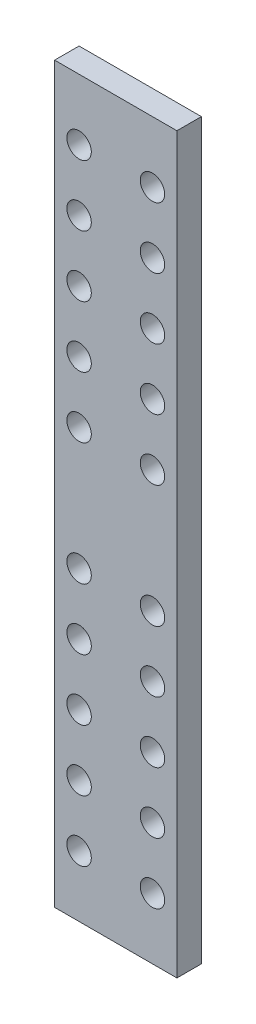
ISO-10303-21;
HEADER;
FILE_DESCRIPTION(('STEP AP214'),'2;1');
FILE_NAME('part.step','',(''),(''),'','','');
FILE_SCHEMA(('AUTOMOTIVE_DESIGN { 1 0 10303 214 1 1 1 1 }'));
ENDSEC;
DATA;
#1=APPLICATION_CONTEXT('core data for automotive mechanical design processes');
#2=APPLICATION_PROTOCOL_DEFINITION('international standard','automotive_design',2000,#1);
#3=PRODUCT_CONTEXT('',#1,'mechanical');
#4=PRODUCT('Part','Part','',(#3));
#5=PRODUCT_RELATED_PRODUCT_CATEGORY('part','',(#4));
#6=PRODUCT_DEFINITION_FORMATION('','',#4);
#7=PRODUCT_DEFINITION_CONTEXT('part definition',#1,'design');
#8=PRODUCT_DEFINITION('design','',#6,#7);
#9=PRODUCT_DEFINITION_SHAPE('','',#8);
#10=(LENGTH_UNIT() NAMED_UNIT(*) SI_UNIT(.MILLI.,.METRE.));
#11=(NAMED_UNIT(*) PLANE_ANGLE_UNIT() SI_UNIT($,.RADIAN.));
#12=(NAMED_UNIT(*) SI_UNIT($,.STERADIAN.) SOLID_ANGLE_UNIT());
#13=UNCERTAINTY_MEASURE_WITH_UNIT(LENGTH_MEASURE(1.E-05),#10,'distance_accuracy_value','');
#14=(GEOMETRIC_REPRESENTATION_CONTEXT(3) GLOBAL_UNCERTAINTY_ASSIGNED_CONTEXT((#13)) GLOBAL_UNIT_ASSIGNED_CONTEXT((#10,
#11,#12)) REPRESENTATION_CONTEXT('',''));
#15=CARTESIAN_POINT('',(0.,0.,0.));
#16=DIRECTION('',(0.,0.,1.));
#17=DIRECTION('',(1.,0.,0.));
#18=AXIS2_PLACEMENT_3D('',#15,#16,#17);
#19=CARTESIAN_POINT('',(0.,0.,10.));
#20=DIRECTION('',(0.,0.,-1.));
#21=DIRECTION('',(-1.,0.,0.));
#22=AXIS2_PLACEMENT_3D('',#19,#20,#21);
#23=PLANE('',#22);
#24=CARTESIAN_POINT('',(15.,-25.,10.));
#25=DIRECTION('',(0.,0.,1.));
#26=DIRECTION('',(1.,0.,0.));
#27=AXIS2_PLACEMENT_3D('',#24,#25,#26);
#28=CIRCLE('',#27,5.);
#29=CARTESIAN_POINT('',(20.,-25.,10.));
#30=VERTEX_POINT('',#29);
#31=EDGE_CURVE('E182',#30,#30,#28,.T.);
#32=ORIENTED_EDGE('',*,*,#31,.F.);
#33=EDGE_LOOP('',(#32));
#34=FACE_BOUND('',#33,.T.);
#35=CARTESIAN_POINT('',(15.,100.,10.));
#36=DIRECTION('',(0.,0.,1.));
#37=DIRECTION('',(1.,0.,0.));
#38=AXIS2_PLACEMENT_3D('',#35,#36,#37);
#39=CIRCLE('',#38,5.);
#40=CARTESIAN_POINT('',(20.,100.,10.));
#41=VERTEX_POINT('',#40);
#42=EDGE_CURVE('E166',#41,#41,#39,.T.);
#43=ORIENTED_EDGE('',*,*,#42,.F.);
#44=EDGE_LOOP('',(#43));
#45=FACE_BOUND('',#44,.T.);
#46=CARTESIAN_POINT('',(-15.,50.,10.));
#47=DIRECTION('',(0.,0.,1.));
#48=DIRECTION('',(1.,0.,0.));
#49=AXIS2_PLACEMENT_3D('',#46,#47,#48);
#50=CIRCLE('',#49,5.);
#51=CARTESIAN_POINT('',(-9.99999999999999,50.,10.));
#52=VERTEX_POINT('',#51);
#53=EDGE_CURVE('E130',#52,#52,#50,.T.);
#54=ORIENTED_EDGE('',*,*,#53,.F.);
#55=EDGE_LOOP('',(#54));
#56=FACE_BOUND('',#55,.T.);
#57=DIRECTION('',(0.,-1.,0.));
#58=VECTOR('',#57,1.);
#59=CARTESIAN_POINT('',(-25.,150.,10.));
#60=LINE('',#59,#58);
#61=CARTESIAN_POINT('',(-25.,150.,10.));
#62=VERTEX_POINT('',#61);
#63=CARTESIAN_POINT('',(-25.,-150.,10.));
#64=VERTEX_POINT('',#63);
#65=EDGE_CURVE('E91',#62,#64,#60,.T.);
#66=ORIENTED_EDGE('',*,*,#65,.T.);
#67=DIRECTION('',(1.,0.,0.));
#68=VECTOR('',#67,1.);
#69=CARTESIAN_POINT('',(25.,-150.,10.));
#70=LINE('',#69,#68);
#71=CARTESIAN_POINT('',(25.,-150.,10.));
#72=VERTEX_POINT('',#71);
#73=EDGE_CURVE('E86',#64,#72,#70,.T.);
#74=ORIENTED_EDGE('',*,*,#73,.T.);
#75=DIRECTION('',(0.,1.,0.));
#76=VECTOR('',#75,1.);
#77=CARTESIAN_POINT('',(25.,150.,10.));
#78=LINE('',#77,#76);
#79=CARTESIAN_POINT('',(25.,150.,10.));
#80=VERTEX_POINT('',#79);
#81=EDGE_CURVE('E93',#72,#80,#78,.T.);
#82=ORIENTED_EDGE('',*,*,#81,.T.);
#83=DIRECTION('',(-1.,0.,0.));
#84=VECTOR('',#83,1.);
#85=CARTESIAN_POINT('',(25.,150.,10.));
#86=LINE('',#85,#84);
#87=EDGE_CURVE('E59',#80,#62,#86,.T.);
#88=ORIENTED_EDGE('',*,*,#87,.T.);
#89=EDGE_LOOP('',(#66,#74,#82,#88));
#90=FACE_BOUND('',#89,.T.);
#91=CARTESIAN_POINT('',(-15.,25.,10.));
#92=DIRECTION('',(0.,0.,1.));
#93=DIRECTION('',(1.,0.,0.));
#94=AXIS2_PLACEMENT_3D('',#91,#92,#93);
#95=CIRCLE('',#94,5.);
#96=CARTESIAN_POINT('',(-9.99999999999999,25.,10.));
#97=VERTEX_POINT('',#96);
#98=EDGE_CURVE('E123',#97,#97,#95,.T.);
#99=ORIENTED_EDGE('',*,*,#98,.F.);
#100=EDGE_LOOP('',(#99));
#101=FACE_BOUND('',#100,.T.);
#102=CARTESIAN_POINT('',(-15.,75.,10.));
#103=DIRECTION('',(0.,0.,1.));
#104=DIRECTION('',(1.,0.,0.));
#105=AXIS2_PLACEMENT_3D('',#102,#103,#104);
#106=CIRCLE('',#105,5.);
#107=CARTESIAN_POINT('',(-9.99999999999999,75.,10.));
#108=VERTEX_POINT('',#107);
#109=EDGE_CURVE('E132',#108,#108,#106,.T.);
#110=ORIENTED_EDGE('',*,*,#109,.F.);
#111=EDGE_LOOP('',(#110));
#112=FACE_BOUND('',#111,.T.);
#113=CARTESIAN_POINT('',(-15.,100.,10.));
#114=DIRECTION('',(0.,0.,1.));
#115=DIRECTION('',(1.,0.,0.));
#116=AXIS2_PLACEMENT_3D('',#113,#114,#115);
#117=CIRCLE('',#116,5.);
#118=CARTESIAN_POINT('',(-10.,100.,10.));
#119=VERTEX_POINT('',#118);
#120=EDGE_CURVE('E139',#119,#119,#117,.T.);
#121=ORIENTED_EDGE('',*,*,#120,.F.);
#122=EDGE_LOOP('',(#121));
#123=FACE_BOUND('',#122,.T.);
#124=CARTESIAN_POINT('',(-15.,125.,10.));
#125=DIRECTION('',(0.,0.,1.));
#126=DIRECTION('',(1.,0.,0.));
#127=AXIS2_PLACEMENT_3D('',#124,#125,#126);
#128=CIRCLE('',#127,5.);
#129=CARTESIAN_POINT('',(-10.,125.,10.));
#130=VERTEX_POINT('',#129);
#131=EDGE_CURVE('E144',#130,#130,#128,.T.);
#132=ORIENTED_EDGE('',*,*,#131,.F.);
#133=EDGE_LOOP('',(#132));
#134=FACE_BOUND('',#133,.T.);
#135=CARTESIAN_POINT('',(15.,25.,10.));
#136=DIRECTION('',(0.,0.,1.));
#137=DIRECTION('',(1.,0.,0.));
#138=AXIS2_PLACEMENT_3D('',#135,#136,#137);
#139=CIRCLE('',#138,5.);
#140=CARTESIAN_POINT('',(20.,25.,10.));
#141=VERTEX_POINT('',#140);
#142=EDGE_CURVE('E151',#141,#141,#139,.T.);
#143=ORIENTED_EDGE('',*,*,#142,.F.);
#144=EDGE_LOOP('',(#143));
#145=FACE_BOUND('',#144,.T.);
#146=CARTESIAN_POINT('',(15.,50.,10.));
#147=DIRECTION('',(0.,0.,1.));
#148=DIRECTION('',(1.,0.,0.));
#149=AXIS2_PLACEMENT_3D('',#146,#147,#148);
#150=CIRCLE('',#149,5.);
#151=CARTESIAN_POINT('',(20.,50.,10.));
#152=VERTEX_POINT('',#151);
#153=EDGE_CURVE('E160',#152,#152,#150,.T.);
#154=ORIENTED_EDGE('',*,*,#153,.F.);
#155=EDGE_LOOP('',(#154));
#156=FACE_BOUND('',#155,.T.);
#157=CARTESIAN_POINT('',(15.,75.,10.));
#158=DIRECTION('',(0.,0.,1.));
#159=DIRECTION('',(1.,0.,0.));
#160=AXIS2_PLACEMENT_3D('',#157,#158,#159);
#161=CIRCLE('',#160,5.);
#162=CARTESIAN_POINT('',(20.,75.,10.));
#163=VERTEX_POINT('',#162);
#164=EDGE_CURVE('E162',#163,#163,#161,.T.);
#165=ORIENTED_EDGE('',*,*,#164,.F.);
#166=EDGE_LOOP('',(#165));
#167=FACE_BOUND('',#166,.T.);
#168=CARTESIAN_POINT('',(15.,125.,10.));
#169=DIRECTION('',(0.,0.,1.));
#170=DIRECTION('',(1.,0.,0.));
#171=AXIS2_PLACEMENT_3D('',#168,#169,#170);
#172=CIRCLE('',#171,5.);
#173=CARTESIAN_POINT('',(20.,125.,10.));
#174=VERTEX_POINT('',#173);
#175=EDGE_CURVE('E171',#174,#174,#172,.T.);
#176=ORIENTED_EDGE('',*,*,#175,.F.);
#177=EDGE_LOOP('',(#176));
#178=FACE_BOUND('',#177,.T.);
#179=CARTESIAN_POINT('',(15.,-50.,10.));
#180=DIRECTION('',(0.,0.,1.));
#181=DIRECTION('',(1.,0.,0.));
#182=AXIS2_PLACEMENT_3D('',#179,#180,#181);
#183=CIRCLE('',#182,5.);
#184=CARTESIAN_POINT('',(20.,-50.,10.));
#185=VERTEX_POINT('',#184);
#186=EDGE_CURVE('E189',#185,#185,#183,.T.);
#187=ORIENTED_EDGE('',*,*,#186,.F.);
#188=EDGE_LOOP('',(#187));
#189=FACE_BOUND('',#188,.T.);
#190=CARTESIAN_POINT('',(15.,-75.,10.));
#191=DIRECTION('',(0.,0.,1.));
#192=DIRECTION('',(1.,0.,0.));
#193=AXIS2_PLACEMENT_3D('',#190,#191,#192);
#194=CIRCLE('',#193,5.);
#195=CARTESIAN_POINT('',(20.,-75.,10.));
#196=VERTEX_POINT('',#195);
#197=EDGE_CURVE('E191',#196,#196,#194,.T.);
#198=ORIENTED_EDGE('',*,*,#197,.F.);
#199=EDGE_LOOP('',(#198));
#200=FACE_BOUND('',#199,.T.);
#201=CARTESIAN_POINT('',(15.,-100.,10.));
#202=DIRECTION('',(0.,0.,1.));
#203=DIRECTION('',(1.,0.,0.));
#204=AXIS2_PLACEMENT_3D('',#201,#202,#203);
#205=CIRCLE('',#204,5.);
#206=CARTESIAN_POINT('',(20.,-100.,10.));
#207=VERTEX_POINT('',#206);
#208=EDGE_CURVE('E200',#207,#207,#205,.T.);
#209=ORIENTED_EDGE('',*,*,#208,.F.);
#210=EDGE_LOOP('',(#209));
#211=FACE_BOUND('',#210,.T.);
#212=CARTESIAN_POINT('',(15.,-125.,10.));
#213=DIRECTION('',(0.,0.,1.));
#214=DIRECTION('',(1.,0.,0.));
#215=AXIS2_PLACEMENT_3D('',#212,#213,#214);
#216=CIRCLE('',#215,5.);
#217=CARTESIAN_POINT('',(20.,-125.,10.));
#218=VERTEX_POINT('',#217);
#219=EDGE_CURVE('E202',#218,#218,#216,.T.);
#220=ORIENTED_EDGE('',*,*,#219,.F.);
#221=EDGE_LOOP('',(#220));
#222=FACE_BOUND('',#221,.T.);
#223=CARTESIAN_POINT('',(-15.,-25.,10.));
#224=DIRECTION('',(0.,0.,1.));
#225=DIRECTION('',(1.,0.,0.));
#226=AXIS2_PLACEMENT_3D('',#223,#224,#225);
#227=CIRCLE('',#226,5.);
#228=CARTESIAN_POINT('',(-9.99999999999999,-25.,10.));
#229=VERTEX_POINT('',#228);
#230=EDGE_CURVE('E211',#229,#229,#227,.T.);
#231=ORIENTED_EDGE('',*,*,#230,.F.);
#232=EDGE_LOOP('',(#231));
#233=FACE_BOUND('',#232,.T.);
#234=CARTESIAN_POINT('',(-15.,-50.,10.));
#235=DIRECTION('',(0.,0.,1.));
#236=DIRECTION('',(1.,0.,0.));
#237=AXIS2_PLACEMENT_3D('',#234,#235,#236);
#238=CIRCLE('',#237,5.);
#239=CARTESIAN_POINT('',(-9.99999999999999,-50.,10.));
#240=VERTEX_POINT('',#239);
#241=EDGE_CURVE('E220',#240,#240,#238,.T.);
#242=ORIENTED_EDGE('',*,*,#241,.F.);
#243=EDGE_LOOP('',(#242));
#244=FACE_BOUND('',#243,.T.);
#245=CARTESIAN_POINT('',(-15.,-75.,10.));
#246=DIRECTION('',(0.,0.,1.));
#247=DIRECTION('',(1.,0.,0.));
#248=AXIS2_PLACEMENT_3D('',#245,#246,#247);
#249=CIRCLE('',#248,5.);
#250=CARTESIAN_POINT('',(-9.99999999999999,-75.,10.));
#251=VERTEX_POINT('',#250);
#252=EDGE_CURVE('E224',#251,#251,#249,.T.);
#253=ORIENTED_EDGE('',*,*,#252,.F.);
#254=EDGE_LOOP('',(#253));
#255=FACE_BOUND('',#254,.T.);
#256=CARTESIAN_POINT('',(-15.,-100.,10.));
#257=DIRECTION('',(0.,0.,1.));
#258=DIRECTION('',(1.,0.,0.));
#259=AXIS2_PLACEMENT_3D('',#256,#257,#258);
#260=CIRCLE('',#259,5.);
#261=CARTESIAN_POINT('',(-10.,-100.,10.));
#262=VERTEX_POINT('',#261);
#263=EDGE_CURVE('E230',#262,#262,#260,.T.);
#264=ORIENTED_EDGE('',*,*,#263,.F.);
#265=EDGE_LOOP('',(#264));
#266=FACE_BOUND('',#265,.T.);
#267=CARTESIAN_POINT('',(-15.,-125.,10.));
#268=DIRECTION('',(0.,0.,1.));
#269=DIRECTION('',(1.,0.,0.));
#270=AXIS2_PLACEMENT_3D('',#267,#268,#269);
#271=CIRCLE('',#270,5.);
#272=CARTESIAN_POINT('',(-10.,-125.,10.));
#273=VERTEX_POINT('',#272);
#274=EDGE_CURVE('E232',#273,#273,#271,.T.);
#275=ORIENTED_EDGE('',*,*,#274,.F.);
#276=EDGE_LOOP('',(#275));
#277=FACE_BOUND('',#276,.T.);
#278=ADVANCED_FACE('F41',(#34,#45,#56,#90,#101,#112,#123,#134,#145,#156,#167,#178,#189,#200,
#211,#222,#233,#244,#255,#266,#277),#23,.F.);
#279=CARTESIAN_POINT('',(-25.,150.,10.));
#280=DIRECTION('',(1.,0.,0.));
#281=DIRECTION('',(0.,0.,-1.));
#282=AXIS2_PLACEMENT_3D('',#279,#280,#281);
#283=PLANE('',#282);
#284=DIRECTION('',(0.,-1.,0.));
#285=VECTOR('',#284,1.);
#286=CARTESIAN_POINT('',(-25.,150.,0.));
#287=LINE('',#286,#285);
#288=CARTESIAN_POINT('',(-25.,150.,0.));
#289=VERTEX_POINT('',#288);
#290=CARTESIAN_POINT('',(-25.,-150.,0.));
#291=VERTEX_POINT('',#290);
#292=EDGE_CURVE('E104',#289,#291,#287,.T.);
#293=ORIENTED_EDGE('',*,*,#292,.T.);
#294=DIRECTION('',(0.,0.,-1.));
#295=VECTOR('',#294,1.);
#296=CARTESIAN_POINT('',(-25.,-150.,10.));
#297=LINE('',#296,#295);
#298=EDGE_CURVE('E11',#64,#291,#297,.T.);
#299=ORIENTED_EDGE('',*,*,#298,.F.);
#300=ORIENTED_EDGE('',*,*,#65,.F.);
#301=DIRECTION('',(0.,0.,-1.));
#302=VECTOR('',#301,1.);
#303=CARTESIAN_POINT('',(-25.,150.,10.));
#304=LINE('',#303,#302);
#305=EDGE_CURVE('E101',#62,#289,#304,.T.);
#306=ORIENTED_EDGE('',*,*,#305,.T.);
#307=EDGE_LOOP('',(#293,#299,#300,#306));
#308=FACE_BOUND('',#307,.T.);
#309=ADVANCED_FACE('F43',(#308),#283,.F.);
#310=CARTESIAN_POINT('',(25.,-150.,10.));
#311=DIRECTION('',(0.,1.,0.));
#312=DIRECTION('',(0.,0.,1.));
#313=AXIS2_PLACEMENT_3D('',#310,#311,#312);
#314=PLANE('',#313);
#315=DIRECTION('',(1.,0.,0.));
#316=VECTOR('',#315,1.);
#317=CARTESIAN_POINT('',(25.,-150.,0.));
#318=LINE('',#317,#316);
#319=CARTESIAN_POINT('',(25.,-150.,0.));
#320=VERTEX_POINT('',#319);
#321=EDGE_CURVE('E100',#291,#320,#318,.T.);
#322=ORIENTED_EDGE('',*,*,#321,.T.);
#323=DIRECTION('',(0.,0.,-1.));
#324=VECTOR('',#323,1.);
#325=CARTESIAN_POINT('',(25.,-150.,10.));
#326=LINE('',#325,#324);
#327=EDGE_CURVE('E49',#72,#320,#326,.T.);
#328=ORIENTED_EDGE('',*,*,#327,.F.);
#329=ORIENTED_EDGE('',*,*,#73,.F.);
#330=ORIENTED_EDGE('',*,*,#298,.T.);
#331=EDGE_LOOP('',(#322,#328,#329,#330));
#332=FACE_BOUND('',#331,.T.);
#333=ADVANCED_FACE('F96',(#332),#314,.F.);
#334=CARTESIAN_POINT('',(25.,150.,10.));
#335=DIRECTION('',(-1.,0.,0.));
#336=DIRECTION('',(0.,0.,1.));
#337=AXIS2_PLACEMENT_3D('',#334,#335,#336);
#338=PLANE('',#337);
#339=DIRECTION('',(0.,1.,0.));
#340=VECTOR('',#339,1.);
#341=CARTESIAN_POINT('',(25.,150.,0.));
#342=LINE('',#341,#340);
#343=CARTESIAN_POINT('',(25.,150.,0.));
#344=VERTEX_POINT('',#343);
#345=EDGE_CURVE('E73',#320,#344,#342,.T.);
#346=ORIENTED_EDGE('',*,*,#345,.T.);
#347=DIRECTION('',(0.,0.,-1.));
#348=VECTOR('',#347,1.);
#349=CARTESIAN_POINT('',(25.,150.,10.));
#350=LINE('',#349,#348);
#351=EDGE_CURVE('E98',#80,#344,#350,.T.);
#352=ORIENTED_EDGE('',*,*,#351,.F.);
#353=ORIENTED_EDGE('',*,*,#81,.F.);
#354=ORIENTED_EDGE('',*,*,#327,.T.);
#355=EDGE_LOOP('',(#346,#352,#353,#354));
#356=FACE_BOUND('',#355,.T.);
#357=ADVANCED_FACE('F97',(#356),#338,.F.);
#358=CARTESIAN_POINT('',(25.,150.,10.));
#359=DIRECTION('',(0.,-1.,0.));
#360=DIRECTION('',(0.,0.,-1.));
#361=AXIS2_PLACEMENT_3D('',#358,#359,#360);
#362=PLANE('',#361);
#363=DIRECTION('',(-1.,0.,0.));
#364=VECTOR('',#363,1.);
#365=CARTESIAN_POINT('',(25.,150.,0.));
#366=LINE('',#365,#364);
#367=EDGE_CURVE('E83',#344,#289,#366,.T.);
#368=ORIENTED_EDGE('',*,*,#367,.T.);
#369=ORIENTED_EDGE('',*,*,#305,.F.);
#370=ORIENTED_EDGE('',*,*,#87,.F.);
#371=ORIENTED_EDGE('',*,*,#351,.T.);
#372=EDGE_LOOP('',(#368,#369,#370,#371));
#373=FACE_BOUND('',#372,.T.);
#374=ADVANCED_FACE('F114',(#373),#362,.F.);
#375=CARTESIAN_POINT('',(0.,0.,0.));
#376=DIRECTION('',(0.,0.,-1.));
#377=DIRECTION('',(-1.,0.,0.));
#378=AXIS2_PLACEMENT_3D('',#375,#376,#377);
#379=PLANE('',#378);
#380=CARTESIAN_POINT('',(-15.,-125.,0.));
#381=DIRECTION('',(0.,0.,-1.));
#382=DIRECTION('',(-1.,0.,0.));
#383=AXIS2_PLACEMENT_3D('',#380,#381,#382);
#384=CIRCLE('',#383,5.);
#385=CARTESIAN_POINT('',(-20.,-125.,0.));
#386=VERTEX_POINT('',#385);
#387=EDGE_CURVE('E235',#386,#386,#384,.T.);
#388=ORIENTED_EDGE('',*,*,#387,.F.);
#389=EDGE_LOOP('',(#388));
#390=FACE_BOUND('',#389,.T.);
#391=CARTESIAN_POINT('',(-15.,-100.,0.));
#392=DIRECTION('',(0.,0.,-1.));
#393=DIRECTION('',(-1.,0.,0.));
#394=AXIS2_PLACEMENT_3D('',#391,#392,#393);
#395=CIRCLE('',#394,5.);
#396=CARTESIAN_POINT('',(-20.,-100.,0.));
#397=VERTEX_POINT('',#396);
#398=EDGE_CURVE('E228',#397,#397,#395,.T.);
#399=ORIENTED_EDGE('',*,*,#398,.F.);
#400=EDGE_LOOP('',(#399));
#401=FACE_BOUND('',#400,.T.);
#402=CARTESIAN_POINT('',(-15.,-75.,0.));
#403=DIRECTION('',(0.,0.,-1.));
#404=DIRECTION('',(-1.,0.,0.));
#405=AXIS2_PLACEMENT_3D('',#402,#403,#404);
#406=CIRCLE('',#405,5.);
#407=CARTESIAN_POINT('',(-20.,-75.,0.));
#408=VERTEX_POINT('',#407);
#409=EDGE_CURVE('E219',#408,#408,#406,.T.);
#410=ORIENTED_EDGE('',*,*,#409,.F.);
#411=EDGE_LOOP('',(#410));
#412=FACE_BOUND('',#411,.T.);
#413=CARTESIAN_POINT('',(-15.,-50.,0.));
#414=DIRECTION('',(0.,0.,-1.));
#415=DIRECTION('',(-1.,0.,0.));
#416=AXIS2_PLACEMENT_3D('',#413,#414,#415);
#417=CIRCLE('',#416,5.);
#418=CARTESIAN_POINT('',(-20.,-50.,0.));
#419=VERTEX_POINT('',#418);
#420=EDGE_CURVE('E212',#419,#419,#417,.T.);
#421=ORIENTED_EDGE('',*,*,#420,.F.);
#422=EDGE_LOOP('',(#421));
#423=FACE_BOUND('',#422,.T.);
#424=CARTESIAN_POINT('',(-15.,-25.,0.));
#425=DIRECTION('',(0.,0.,-1.));
#426=DIRECTION('',(-1.,0.,0.));
#427=AXIS2_PLACEMENT_3D('',#424,#425,#426);
#428=CIRCLE('',#427,5.);
#429=CARTESIAN_POINT('',(-20.,-25.,0.));
#430=VERTEX_POINT('',#429);
#431=EDGE_CURVE('E208',#430,#430,#428,.T.);
#432=ORIENTED_EDGE('',*,*,#431,.F.);
#433=EDGE_LOOP('',(#432));
#434=FACE_BOUND('',#433,.T.);
#435=CARTESIAN_POINT('',(15.,-125.,0.));
#436=DIRECTION('',(0.,0.,-1.));
#437=DIRECTION('',(-1.,0.,0.));
#438=AXIS2_PLACEMENT_3D('',#435,#436,#437);
#439=CIRCLE('',#438,5.);
#440=CARTESIAN_POINT('',(10.,-125.,0.));
#441=VERTEX_POINT('',#440);
#442=EDGE_CURVE('E205',#441,#441,#439,.T.);
#443=ORIENTED_EDGE('',*,*,#442,.F.);
#444=EDGE_LOOP('',(#443));
#445=FACE_BOUND('',#444,.T.);
#446=CARTESIAN_POINT('',(15.,-100.,0.));
#447=DIRECTION('',(0.,0.,-1.));
#448=DIRECTION('',(-1.,0.,0.));
#449=AXIS2_PLACEMENT_3D('',#446,#447,#448);
#450=CIRCLE('',#449,5.);
#451=CARTESIAN_POINT('',(10.,-100.,0.));
#452=VERTEX_POINT('',#451);
#453=EDGE_CURVE('E198',#452,#452,#450,.T.);
#454=ORIENTED_EDGE('',*,*,#453,.F.);
#455=EDGE_LOOP('',(#454));
#456=FACE_BOUND('',#455,.T.);
#457=CARTESIAN_POINT('',(15.,-75.,0.));
#458=DIRECTION('',(0.,0.,-1.));
#459=DIRECTION('',(-1.,0.,0.));
#460=AXIS2_PLACEMENT_3D('',#457,#458,#459);
#461=CIRCLE('',#460,5.);
#462=CARTESIAN_POINT('',(9.99999999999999,-75.,0.));
#463=VERTEX_POINT('',#462);
#464=EDGE_CURVE('E186',#463,#463,#461,.T.);
#465=ORIENTED_EDGE('',*,*,#464,.F.);
#466=EDGE_LOOP('',(#465));
#467=FACE_BOUND('',#466,.T.);
#468=CARTESIAN_POINT('',(15.,-50.,0.));
#469=DIRECTION('',(0.,0.,-1.));
#470=DIRECTION('',(-1.,0.,0.));
#471=AXIS2_PLACEMENT_3D('',#468,#469,#470);
#472=CIRCLE('',#471,5.);
#473=CARTESIAN_POINT('',(9.99999999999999,-50.,0.));
#474=VERTEX_POINT('',#473);
#475=EDGE_CURVE('E184',#474,#474,#472,.T.);
#476=ORIENTED_EDGE('',*,*,#475,.F.);
#477=EDGE_LOOP('',(#476));
#478=FACE_BOUND('',#477,.T.);
#479=CARTESIAN_POINT('',(15.,-25.,0.));
#480=DIRECTION('',(0.,0.,-1.));
#481=DIRECTION('',(-1.,0.,0.));
#482=AXIS2_PLACEMENT_3D('',#479,#480,#481);
#483=CIRCLE('',#482,5.);
#484=CARTESIAN_POINT('',(9.99999999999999,-25.,0.));
#485=VERTEX_POINT('',#484);
#486=EDGE_CURVE('E176',#485,#485,#483,.T.);
#487=ORIENTED_EDGE('',*,*,#486,.F.);
#488=EDGE_LOOP('',(#487));
#489=FACE_BOUND('',#488,.T.);
#490=CARTESIAN_POINT('',(15.,125.,0.));
#491=DIRECTION('',(0.,0.,-1.));
#492=DIRECTION('',(-1.,0.,0.));
#493=AXIS2_PLACEMENT_3D('',#490,#491,#492);
#494=CIRCLE('',#493,5.);
#495=CARTESIAN_POINT('',(10.,125.,0.));
#496=VERTEX_POINT('',#495);
#497=EDGE_CURVE('E174',#496,#496,#494,.T.);
#498=ORIENTED_EDGE('',*,*,#497,.F.);
#499=EDGE_LOOP('',(#498));
#500=FACE_BOUND('',#499,.T.);
#501=CARTESIAN_POINT('',(15.,100.,0.));
#502=DIRECTION('',(0.,0.,-1.));
#503=DIRECTION('',(-1.,0.,0.));
#504=AXIS2_PLACEMENT_3D('',#501,#502,#503);
#505=CIRCLE('',#504,5.);
#506=CARTESIAN_POINT('',(10.,100.,0.));
#507=VERTEX_POINT('',#506);
#508=EDGE_CURVE('E167',#507,#507,#505,.T.);
#509=ORIENTED_EDGE('',*,*,#508,.F.);
#510=EDGE_LOOP('',(#509));
#511=FACE_BOUND('',#510,.T.);
#512=CARTESIAN_POINT('',(15.,75.,0.));
#513=DIRECTION('',(0.,0.,-1.));
#514=DIRECTION('',(-1.,0.,0.));
#515=AXIS2_PLACEMENT_3D('',#512,#513,#514);
#516=CIRCLE('',#515,5.);
#517=CARTESIAN_POINT('',(9.99999999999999,75.,0.));
#518=VERTEX_POINT('',#517);
#519=EDGE_CURVE('E159',#518,#518,#516,.T.);
#520=ORIENTED_EDGE('',*,*,#519,.F.);
#521=EDGE_LOOP('',(#520));
#522=FACE_BOUND('',#521,.T.);
#523=CARTESIAN_POINT('',(15.,50.,0.));
#524=DIRECTION('',(0.,0.,-1.));
#525=DIRECTION('',(-1.,0.,0.));
#526=AXIS2_PLACEMENT_3D('',#523,#524,#525);
#527=CIRCLE('',#526,5.);
#528=CARTESIAN_POINT('',(9.99999999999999,50.,0.));
#529=VERTEX_POINT('',#528);
#530=EDGE_CURVE('E152',#529,#529,#527,.T.);
#531=ORIENTED_EDGE('',*,*,#530,.F.);
#532=EDGE_LOOP('',(#531));
#533=FACE_BOUND('',#532,.T.);
#534=CARTESIAN_POINT('',(15.,25.,0.));
#535=DIRECTION('',(0.,0.,-1.));
#536=DIRECTION('',(-1.,0.,0.));
#537=AXIS2_PLACEMENT_3D('',#534,#535,#536);
#538=CIRCLE('',#537,5.);
#539=CARTESIAN_POINT('',(9.99999999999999,25.,0.));
#540=VERTEX_POINT('',#539);
#541=EDGE_CURVE('E146',#540,#540,#538,.T.);
#542=ORIENTED_EDGE('',*,*,#541,.F.);
#543=EDGE_LOOP('',(#542));
#544=FACE_BOUND('',#543,.T.);
#545=CARTESIAN_POINT('',(-15.,125.,0.));
#546=DIRECTION('',(0.,0.,-1.));
#547=DIRECTION('',(-1.,0.,0.));
#548=AXIS2_PLACEMENT_3D('',#545,#546,#547);
#549=CIRCLE('',#548,5.);
#550=CARTESIAN_POINT('',(-20.,125.,0.));
#551=VERTEX_POINT('',#550);
#552=EDGE_CURVE('E142',#551,#551,#549,.T.);
#553=ORIENTED_EDGE('',*,*,#552,.F.);
#554=EDGE_LOOP('',(#553));
#555=FACE_BOUND('',#554,.T.);
#556=CARTESIAN_POINT('',(-15.,100.,0.));
#557=DIRECTION('',(0.,0.,-1.));
#558=DIRECTION('',(-1.,0.,0.));
#559=AXIS2_PLACEMENT_3D('',#556,#557,#558);
#560=CIRCLE('',#559,5.);
#561=CARTESIAN_POINT('',(-20.,100.,0.));
#562=VERTEX_POINT('',#561);
#563=EDGE_CURVE('E138',#562,#562,#560,.T.);
#564=ORIENTED_EDGE('',*,*,#563,.F.);
#565=EDGE_LOOP('',(#564));
#566=FACE_BOUND('',#565,.T.);
#567=CARTESIAN_POINT('',(-15.,75.,0.));
#568=DIRECTION('',(0.,0.,-1.));
#569=DIRECTION('',(-1.,0.,0.));
#570=AXIS2_PLACEMENT_3D('',#567,#568,#569);
#571=CIRCLE('',#570,5.);
#572=CARTESIAN_POINT('',(-20.,75.,0.));
#573=VERTEX_POINT('',#572);
#574=EDGE_CURVE('E128',#573,#573,#571,.T.);
#575=ORIENTED_EDGE('',*,*,#574,.F.);
#576=EDGE_LOOP('',(#575));
#577=FACE_BOUND('',#576,.T.);
#578=CARTESIAN_POINT('',(-15.,50.,0.));
#579=DIRECTION('',(0.,0.,-1.));
#580=DIRECTION('',(-1.,0.,0.));
#581=AXIS2_PLACEMENT_3D('',#578,#579,#580);
#582=CIRCLE('',#581,5.);
#583=CARTESIAN_POINT('',(-20.,50.,0.));
#584=VERTEX_POINT('',#583);
#585=EDGE_CURVE('E124',#584,#584,#582,.T.);
#586=ORIENTED_EDGE('',*,*,#585,.F.);
#587=EDGE_LOOP('',(#586));
#588=FACE_BOUND('',#587,.T.);
#589=CARTESIAN_POINT('',(-15.,25.,0.));
#590=DIRECTION('',(0.,0.,-1.));
#591=DIRECTION('',(-1.,0.,0.));
#592=AXIS2_PLACEMENT_3D('',#589,#590,#591);
#593=CIRCLE('',#592,5.);
#594=CARTESIAN_POINT('',(-20.,25.,0.));
#595=VERTEX_POINT('',#594);
#596=EDGE_CURVE('E107',#595,#595,#593,.T.);
#597=ORIENTED_EDGE('',*,*,#596,.F.);
#598=EDGE_LOOP('',(#597));
#599=FACE_BOUND('',#598,.T.);
#600=ORIENTED_EDGE('',*,*,#292,.F.);
#601=ORIENTED_EDGE('',*,*,#367,.F.);
#602=ORIENTED_EDGE('',*,*,#345,.F.);
#603=ORIENTED_EDGE('',*,*,#321,.F.);
#604=EDGE_LOOP('',(#600,#601,#602,#603));
#605=FACE_BOUND('',#604,.T.);
#606=ADVANCED_FACE('F118',(#390,#401,#412,#423,#434,#445,#456,#467,#478,#489,#500,#511,#522,
#533,#544,#555,#566,#577,#588,#599,#605),#379,.T.);
#607=CARTESIAN_POINT('',(-15.,25.,10.));
#608=DIRECTION('',(0.,0.,1.));
#609=DIRECTION('',(1.,0.,0.));
#610=AXIS2_PLACEMENT_3D('',#607,#608,#609);
#611=CYLINDRICAL_SURFACE('',#610,5.);
#612=ORIENTED_EDGE('',*,*,#98,.T.);
#613=EDGE_LOOP('',(#612));
#614=FACE_BOUND('',#613,.T.);
#615=ORIENTED_EDGE('',*,*,#596,.T.);
#616=EDGE_LOOP('',(#615));
#617=FACE_BOUND('',#616,.T.);
#618=ADVANCED_FACE('F255',(#614,#617),#611,.F.);
#619=CARTESIAN_POINT('',(-15.,50.,10.));
#620=DIRECTION('',(0.,0.,1.));
#621=DIRECTION('',(1.,0.,0.));
#622=AXIS2_PLACEMENT_3D('',#619,#620,#621);
#623=CYLINDRICAL_SURFACE('',#622,5.);
#624=ORIENTED_EDGE('',*,*,#53,.T.);
#625=EDGE_LOOP('',(#624));
#626=FACE_BOUND('',#625,.T.);
#627=ORIENTED_EDGE('',*,*,#585,.T.);
#628=EDGE_LOOP('',(#627));
#629=FACE_BOUND('',#628,.T.);
#630=ADVANCED_FACE('F283',(#626,#629),#623,.F.);
#631=CARTESIAN_POINT('',(-15.,75.,10.));
#632=DIRECTION('',(0.,0.,1.));
#633=DIRECTION('',(1.,0.,0.));
#634=AXIS2_PLACEMENT_3D('',#631,#632,#633);
#635=CYLINDRICAL_SURFACE('',#634,5.);
#636=ORIENTED_EDGE('',*,*,#109,.T.);
#637=EDGE_LOOP('',(#636));
#638=FACE_BOUND('',#637,.T.);
#639=ORIENTED_EDGE('',*,*,#574,.T.);
#640=EDGE_LOOP('',(#639));
#641=FACE_BOUND('',#640,.T.);
#642=ADVANCED_FACE('F286',(#638,#641),#635,.F.);
#643=CARTESIAN_POINT('',(-15.,100.,10.));
#644=DIRECTION('',(0.,0.,1.));
#645=DIRECTION('',(1.,0.,0.));
#646=AXIS2_PLACEMENT_3D('',#643,#644,#645);
#647=CYLINDRICAL_SURFACE('',#646,5.);
#648=ORIENTED_EDGE('',*,*,#120,.T.);
#649=EDGE_LOOP('',(#648));
#650=FACE_BOUND('',#649,.T.);
#651=ORIENTED_EDGE('',*,*,#563,.T.);
#652=EDGE_LOOP('',(#651));
#653=FACE_BOUND('',#652,.T.);
#654=ADVANCED_FACE('F293',(#650,#653),#647,.F.);
#655=CARTESIAN_POINT('',(-15.,125.,10.));
#656=DIRECTION('',(0.,0.,1.));
#657=DIRECTION('',(1.,0.,0.));
#658=AXIS2_PLACEMENT_3D('',#655,#656,#657);
#659=CYLINDRICAL_SURFACE('',#658,5.);
#660=ORIENTED_EDGE('',*,*,#131,.T.);
#661=EDGE_LOOP('',(#660));
#662=FACE_BOUND('',#661,.T.);
#663=ORIENTED_EDGE('',*,*,#552,.T.);
#664=EDGE_LOOP('',(#663));
#665=FACE_BOUND('',#664,.T.);
#666=ADVANCED_FACE('F301',(#662,#665),#659,.F.);
#667=CARTESIAN_POINT('',(15.,25.,10.));
#668=DIRECTION('',(0.,0.,1.));
#669=DIRECTION('',(1.,0.,0.));
#670=AXIS2_PLACEMENT_3D('',#667,#668,#669);
#671=CYLINDRICAL_SURFACE('',#670,5.);
#672=ORIENTED_EDGE('',*,*,#142,.T.);
#673=EDGE_LOOP('',(#672));
#674=FACE_BOUND('',#673,.T.);
#675=ORIENTED_EDGE('',*,*,#541,.T.);
#676=EDGE_LOOP('',(#675));
#677=FACE_BOUND('',#676,.T.);
#678=ADVANCED_FACE('F313',(#674,#677),#671,.F.);
#679=CARTESIAN_POINT('',(15.,50.,10.));
#680=DIRECTION('',(0.,0.,1.));
#681=DIRECTION('',(1.,0.,0.));
#682=AXIS2_PLACEMENT_3D('',#679,#680,#681);
#683=CYLINDRICAL_SURFACE('',#682,5.);
#684=ORIENTED_EDGE('',*,*,#153,.T.);
#685=EDGE_LOOP('',(#684));
#686=FACE_BOUND('',#685,.T.);
#687=ORIENTED_EDGE('',*,*,#530,.T.);
#688=EDGE_LOOP('',(#687));
#689=FACE_BOUND('',#688,.T.);
#690=ADVANCED_FACE('F317',(#686,#689),#683,.F.);
#691=CARTESIAN_POINT('',(15.,75.,10.));
#692=DIRECTION('',(0.,0.,1.));
#693=DIRECTION('',(1.,0.,0.));
#694=AXIS2_PLACEMENT_3D('',#691,#692,#693);
#695=CYLINDRICAL_SURFACE('',#694,5.);
#696=ORIENTED_EDGE('',*,*,#164,.T.);
#697=EDGE_LOOP('',(#696));
#698=FACE_BOUND('',#697,.T.);
#699=ORIENTED_EDGE('',*,*,#519,.T.);
#700=EDGE_LOOP('',(#699));
#701=FACE_BOUND('',#700,.T.);
#702=ADVANCED_FACE('F330',(#698,#701),#695,.F.);
#703=CARTESIAN_POINT('',(15.,100.,10.));
#704=DIRECTION('',(0.,0.,1.));
#705=DIRECTION('',(1.,0.,0.));
#706=AXIS2_PLACEMENT_3D('',#703,#704,#705);
#707=CYLINDRICAL_SURFACE('',#706,5.);
#708=ORIENTED_EDGE('',*,*,#42,.T.);
#709=EDGE_LOOP('',(#708));
#710=FACE_BOUND('',#709,.T.);
#711=ORIENTED_EDGE('',*,*,#508,.T.);
#712=EDGE_LOOP('',(#711));
#713=FACE_BOUND('',#712,.T.);
#714=ADVANCED_FACE('F333',(#710,#713),#707,.F.);
#715=CARTESIAN_POINT('',(15.,125.,10.));
#716=DIRECTION('',(0.,0.,1.));
#717=DIRECTION('',(1.,0.,0.));
#718=AXIS2_PLACEMENT_3D('',#715,#716,#717);
#719=CYLINDRICAL_SURFACE('',#718,5.);
#720=ORIENTED_EDGE('',*,*,#175,.T.);
#721=EDGE_LOOP('',(#720));
#722=FACE_BOUND('',#721,.T.);
#723=ORIENTED_EDGE('',*,*,#497,.T.);
#724=EDGE_LOOP('',(#723));
#725=FACE_BOUND('',#724,.T.);
#726=ADVANCED_FACE('F345',(#722,#725),#719,.F.);
#727=CARTESIAN_POINT('',(15.,-25.,10.));
#728=DIRECTION('',(0.,0.,1.));
#729=DIRECTION('',(1.,0.,0.));
#730=AXIS2_PLACEMENT_3D('',#727,#728,#729);
#731=CYLINDRICAL_SURFACE('',#730,5.);
#732=ORIENTED_EDGE('',*,*,#31,.T.);
#733=EDGE_LOOP('',(#732));
#734=FACE_BOUND('',#733,.T.);
#735=ORIENTED_EDGE('',*,*,#486,.T.);
#736=EDGE_LOOP('',(#735));
#737=FACE_BOUND('',#736,.T.);
#738=ADVANCED_FACE('F349',(#734,#737),#731,.F.);
#739=CARTESIAN_POINT('',(15.,-50.,10.));
#740=DIRECTION('',(0.,0.,1.));
#741=DIRECTION('',(1.,0.,0.));
#742=AXIS2_PLACEMENT_3D('',#739,#740,#741);
#743=CYLINDRICAL_SURFACE('',#742,5.);
#744=ORIENTED_EDGE('',*,*,#186,.T.);
#745=EDGE_LOOP('',(#744));
#746=FACE_BOUND('',#745,.T.);
#747=ORIENTED_EDGE('',*,*,#475,.T.);
#748=EDGE_LOOP('',(#747));
#749=FACE_BOUND('',#748,.T.);
#750=ADVANCED_FACE('F363',(#746,#749),#743,.F.);
#751=CARTESIAN_POINT('',(15.,-75.,10.));
#752=DIRECTION('',(0.,0.,1.));
#753=DIRECTION('',(1.,0.,0.));
#754=AXIS2_PLACEMENT_3D('',#751,#752,#753);
#755=CYLINDRICAL_SURFACE('',#754,5.);
#756=ORIENTED_EDGE('',*,*,#197,.T.);
#757=EDGE_LOOP('',(#756));
#758=FACE_BOUND('',#757,.T.);
#759=ORIENTED_EDGE('',*,*,#464,.T.);
#760=EDGE_LOOP('',(#759));
#761=FACE_BOUND('',#760,.T.);
#762=ADVANCED_FACE('F369',(#758,#761),#755,.F.);
#763=CARTESIAN_POINT('',(15.,-100.,10.));
#764=DIRECTION('',(0.,0.,1.));
#765=DIRECTION('',(1.,0.,0.));
#766=AXIS2_PLACEMENT_3D('',#763,#764,#765);
#767=CYLINDRICAL_SURFACE('',#766,5.);
#768=ORIENTED_EDGE('',*,*,#208,.T.);
#769=EDGE_LOOP('',(#768));
#770=FACE_BOUND('',#769,.T.);
#771=ORIENTED_EDGE('',*,*,#453,.T.);
#772=EDGE_LOOP('',(#771));
#773=FACE_BOUND('',#772,.T.);
#774=ADVANCED_FACE('F380',(#770,#773),#767,.F.);
#775=CARTESIAN_POINT('',(15.,-125.,10.));
#776=DIRECTION('',(0.,0.,1.));
#777=DIRECTION('',(1.,0.,0.));
#778=AXIS2_PLACEMENT_3D('',#775,#776,#777);
#779=CYLINDRICAL_SURFACE('',#778,5.);
#780=ORIENTED_EDGE('',*,*,#219,.T.);
#781=EDGE_LOOP('',(#780));
#782=FACE_BOUND('',#781,.T.);
#783=ORIENTED_EDGE('',*,*,#442,.T.);
#784=EDGE_LOOP('',(#783));
#785=FACE_BOUND('',#784,.T.);
#786=ADVANCED_FACE('F384',(#782,#785),#779,.F.);
#787=CARTESIAN_POINT('',(-15.,-25.,10.));
#788=DIRECTION('',(0.,0.,1.));
#789=DIRECTION('',(1.,0.,0.));
#790=AXIS2_PLACEMENT_3D('',#787,#788,#789);
#791=CYLINDRICAL_SURFACE('',#790,5.);
#792=ORIENTED_EDGE('',*,*,#230,.T.);
#793=EDGE_LOOP('',(#792));
#794=FACE_BOUND('',#793,.T.);
#795=ORIENTED_EDGE('',*,*,#431,.T.);
#796=EDGE_LOOP('',(#795));
#797=FACE_BOUND('',#796,.T.);
#798=ADVANCED_FACE('F392',(#794,#797),#791,.F.);
#799=CARTESIAN_POINT('',(-15.,-50.,10.));
#800=DIRECTION('',(0.,0.,1.));
#801=DIRECTION('',(1.,0.,0.));
#802=AXIS2_PLACEMENT_3D('',#799,#800,#801);
#803=CYLINDRICAL_SURFACE('',#802,5.);
#804=ORIENTED_EDGE('',*,*,#241,.T.);
#805=EDGE_LOOP('',(#804));
#806=FACE_BOUND('',#805,.T.);
#807=ORIENTED_EDGE('',*,*,#420,.T.);
#808=EDGE_LOOP('',(#807));
#809=FACE_BOUND('',#808,.T.);
#810=ADVANCED_FACE('F402',(#806,#809),#803,.F.);
#811=CARTESIAN_POINT('',(-15.,-75.,10.));
#812=DIRECTION('',(0.,0.,1.));
#813=DIRECTION('',(1.,0.,0.));
#814=AXIS2_PLACEMENT_3D('',#811,#812,#813);
#815=CYLINDRICAL_SURFACE('',#814,5.);
#816=ORIENTED_EDGE('',*,*,#252,.T.);
#817=EDGE_LOOP('',(#816));
#818=FACE_BOUND('',#817,.T.);
#819=ORIENTED_EDGE('',*,*,#409,.T.);
#820=EDGE_LOOP('',(#819));
#821=FACE_BOUND('',#820,.T.);
#822=ADVANCED_FACE('F410',(#818,#821),#815,.F.);
#823=CARTESIAN_POINT('',(-15.,-100.,10.));
#824=DIRECTION('',(0.,0.,1.));
#825=DIRECTION('',(1.,0.,0.));
#826=AXIS2_PLACEMENT_3D('',#823,#824,#825);
#827=CYLINDRICAL_SURFACE('',#826,5.);
#828=ORIENTED_EDGE('',*,*,#263,.T.);
#829=EDGE_LOOP('',(#828));
#830=FACE_BOUND('',#829,.T.);
#831=ORIENTED_EDGE('',*,*,#398,.T.);
#832=EDGE_LOOP('',(#831));
#833=FACE_BOUND('',#832,.T.);
#834=ADVANCED_FACE('F417',(#830,#833),#827,.F.);
#835=CARTESIAN_POINT('',(-15.,-125.,10.));
#836=DIRECTION('',(0.,0.,1.));
#837=DIRECTION('',(1.,0.,0.));
#838=AXIS2_PLACEMENT_3D('',#835,#836,#837);
#839=CYLINDRICAL_SURFACE('',#838,5.);
#840=ORIENTED_EDGE('',*,*,#274,.T.);
#841=EDGE_LOOP('',(#840));
#842=FACE_BOUND('',#841,.T.);
#843=ORIENTED_EDGE('',*,*,#387,.T.);
#844=EDGE_LOOP('',(#843));
#845=FACE_BOUND('',#844,.T.);
#846=ADVANCED_FACE('F239',(#842,#845),#839,.F.);
#847=CLOSED_SHELL('',(#278,#309,#333,#357,#374,#606,#618,#630,#642,#654,#666,#678,#690,#702,
#714,#726,#738,#750,#762,#774,#786,#798,#810,#822,#834,#846));
#848=MANIFOLD_SOLID_BREP('B2',#847);
#849=ADVANCED_BREP_SHAPE_REPRESENTATION('',(#18,#848),#14);
#850=SHAPE_DEFINITION_REPRESENTATION(#9,#849);
ENDSEC;
END-ISO-10303-21;
